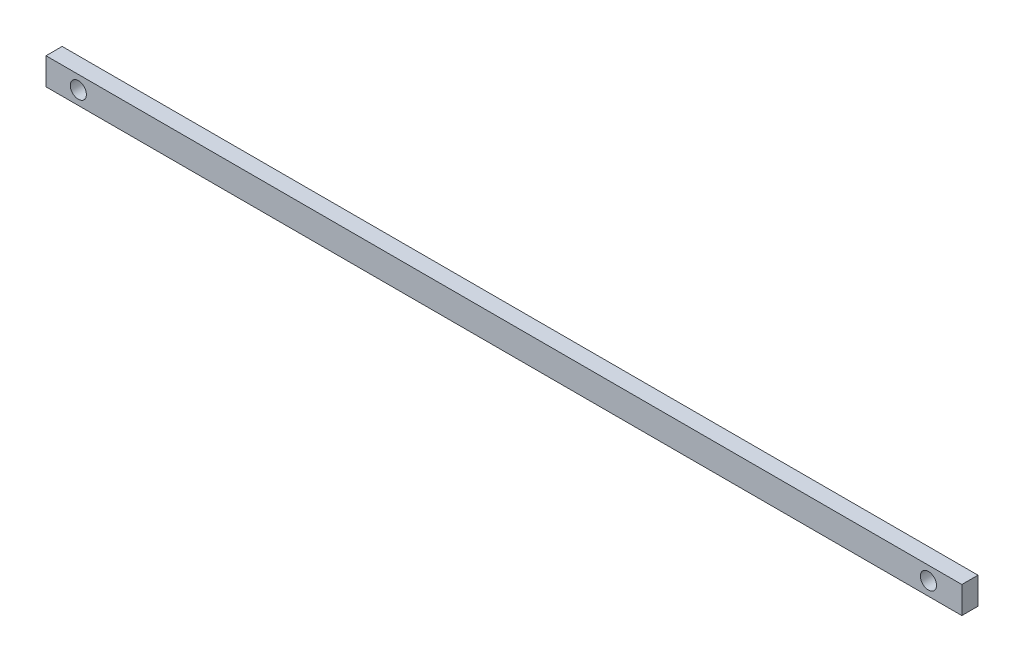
from build123d import *

# Parameters (mm, degrees)
ESQUISSE1_W        = 850
ESQUISSE1_H        = 25
ESQUISSE1_R        = 7.5
BOSS_EXTRU_1_DEPTH = 15


with BuildPart() as part:
    # Esquisse1 → Boss.-Extru.1 (new body)
    with BuildSketch(Plane.XY):
        with Locations((425, 12.5)):
            Rectangle(ESQUISSE1_W, ESQUISSE1_H)
        with Locations((30, 12.5)):
            Circle(ESQUISSE1_R, mode=Mode.SUBTRACT)
        with Locations((819, 12.5)):
            Circle(ESQUISSE1_R, mode=Mode.SUBTRACT)
    extrude(amount=BOSS_EXTRU_1_DEPTH)


solid = part.part
